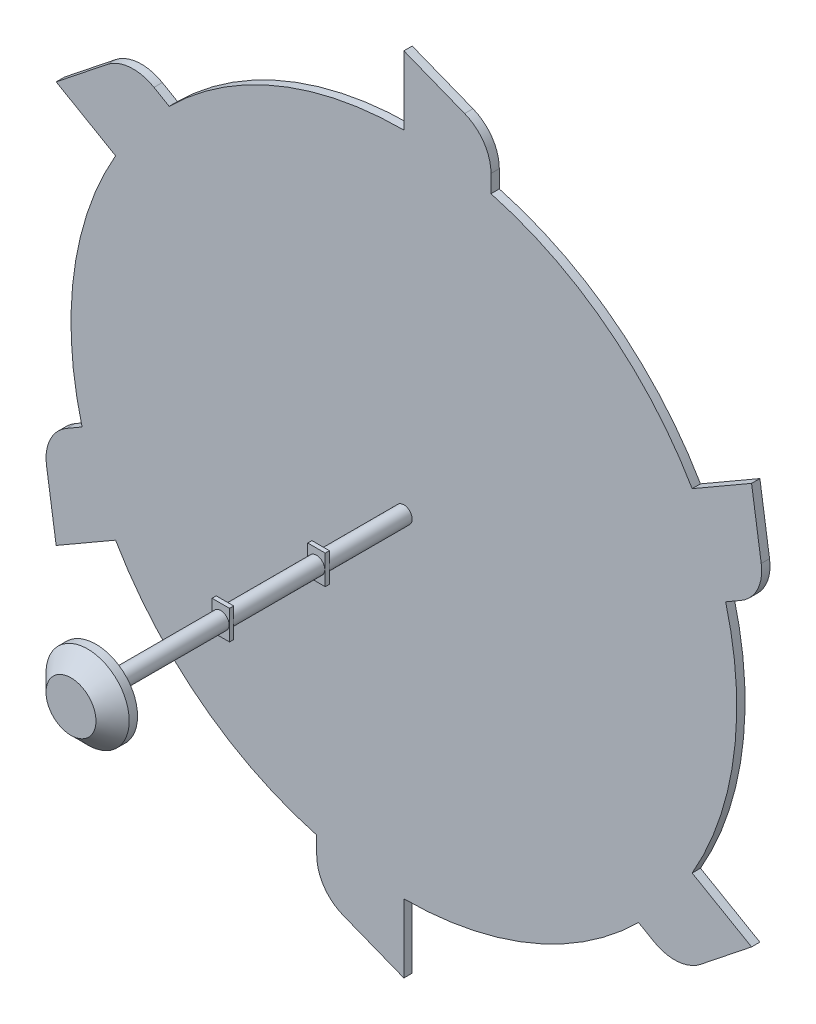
from build123d import *

# Parameters (mm, degrees)
ESQUISSE1_R                        = 10
EXTRUSION1_DEPTH                   = 150
ESQUISSE2_W                        = 21
ESQUISSE2_H                        = 35
EXTRUSION2_DEPTH                   = 5
EXTRUSION3_START                   = 110
ESQUISSE3_R                        = 10
EXTRUSION3_DEPTH                   = 110
ESQUISSE4_W                        = 21
ESQUISSE4_H                        = 35
EXTRUSION4_DEPTH                   = 5
EXTRUSION5_START                   = 100
ESQUISSE5_R                        = 10
EXTRUSION5_DEPTH                   = 100
ESQUISSE7_R                        = 50
EXTRUSION7_DEPTH                   = 30
CHANFREIN2_SIZE                    = 20
ESQUISSE12_R                       = 400
EXTRUSION10_DEPTH                  = 10
EXTRUSION11_DEPTH                  = 10
CONG_1_R                           = 50
R_P_TITION_CIRCULAIRE1_COUNT       = 6
CONG_1_OF_R_P_TITION_CIRCULAIRE1_R = 50


with BuildPart() as part:
    # Esquisse1 → Extrusion1 (new body)
    with BuildSketch(Plane.XY):
        Circle(ESQUISSE1_R)
    extrude(amount=EXTRUSION1_DEPTH)

    # Esquisse2 → Extrusion2 (add)
    with BuildSketch(Plane(origin=(0, 0, 0), x_dir=(-1, 0, 0), z_dir=(0, 0, -1))):
        Rectangle(ESQUISSE2_W, ESQUISSE2_H)
    extrude(amount=EXTRUSION2_DEPTH)

    # Esquisse3 → Extrusion3 (add)
    with BuildSketch(Plane(origin=(0, 0, -5), x_dir=(-1, 0, 0), z_dir=(0, 0, -1)).offset(EXTRUSION3_START)):
        Circle(ESQUISSE3_R)
    extrude(amount=-EXTRUSION3_DEPTH)

    # Esquisse4 → Extrusion4 (add)
    with BuildSketch(Plane(origin=(0, 0, -115), x_dir=(-1, 0, 0), z_dir=(0, 0, -1))):
        Rectangle(ESQUISSE4_W, ESQUISSE4_H)
    extrude(amount=EXTRUSION4_DEPTH)

    # Esquisse5 → Extrusion5 (add)
    with BuildSketch(Plane(origin=(0, 0, -120), x_dir=(-1, 0, 0), z_dir=(0, 0, -1)).offset(EXTRUSION5_START)):
        Circle(ESQUISSE5_R)
    extrude(amount=-EXTRUSION5_DEPTH)

    # Esquisse7 → Extrusion7 (add)
    with BuildSketch(Plane.XY.offset(150)):
        Circle(ESQUISSE7_R)
    extrude(amount=EXTRUSION7_DEPTH)

    # Chanfrein2
    chanfrein2_edges = [part.edges().sort_by_distance(p)[0] for p in [
        (-50, 0, 180),
    ]]
    chamfer(chanfrein2_edges, length=CHANFREIN2_SIZE)

    # Esquisse12 → Extrusion10 (add)
    with BuildSketch(Plane(origin=(0, 0, -220), x_dir=(-1, 0, 0), z_dir=(0, 0, -1))):
        Circle(ESQUISSE12_R)
    extrude(amount=EXTRUSION10_DEPTH)

    # Esquisse13 → Extrusion11 (add)
    with BuildSketch(Plane.XY.offset(-220)):
        with BuildLine():
            Line((0, -400), (0, -482.428330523))
            Line((0, -482.428330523), (-104.688026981, -441.214165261))
            Line((-104.688026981, -441.214165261), (-104.688026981, -386.057530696))
            ThreePointArc((-104.688026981, -386.057530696), (-52.806191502, -396.499061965), (0, -400))
        make_face()
    extrusion11 = extrude(amount=-EXTRUSION11_DEPTH)

    # Cong_1
    cong_1_edges = [part.edges().sort_by_distance(p)[0] for p in [
        (-104.688026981, -441.214165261, -225),
    ]]
    fillet(cong_1_edges, radius=CONG_1_R)

    # R_p_tition circulaire1: Extrusion11 ×6 about axis
    r_p_tition_circulaire1_axis = Axis((0, 0, 0), (0, 0, 1))
    for i in range(1, R_P_TITION_CIRCULAIRE1_COUNT):
        add(extrusion11.rotate(r_p_tition_circulaire1_axis, i * 360 / R_P_TITION_CIRCULAIRE1_COUNT))

    # Cong_1 of R_p_tition circulaire1
    cong_1_of_r_p_tition_circulaire1_edges = [part.edges().sort_by_distance(p)[0] for p in [
        (329.758662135, -311.269573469, -225),
        (434.446689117, 129.944591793, -225),
        (104.688026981, 441.214165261, -225),
        (-329.758662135, 311.269573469, -225),
        (-434.446689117, -129.944591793, -225),
    ]]
    fillet(cong_1_of_r_p_tition_circulaire1_edges, radius=CONG_1_OF_R_P_TITION_CIRCULAIRE1_R)


solid = part.part
